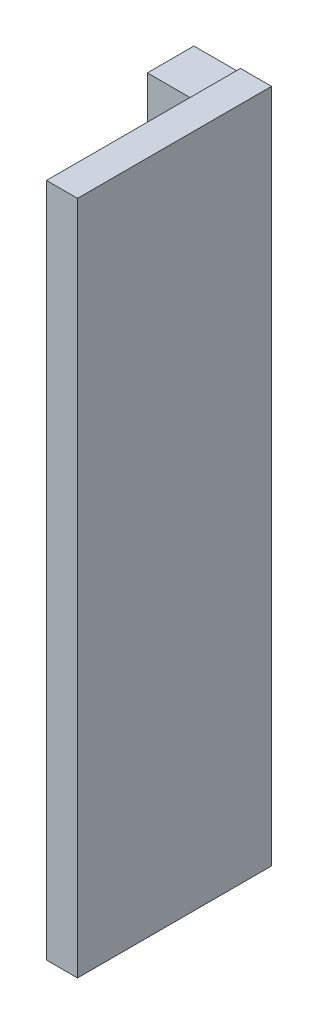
ISO-10303-21;
HEADER;
FILE_DESCRIPTION(('STEP AP214'),'2;1');
FILE_NAME('part.step','',(''),(''),'','','');
FILE_SCHEMA(('AUTOMOTIVE_DESIGN { 1 0 10303 214 1 1 1 1 }'));
ENDSEC;
DATA;
#1=APPLICATION_CONTEXT('core data for automotive mechanical design processes');
#2=APPLICATION_PROTOCOL_DEFINITION('international standard','automotive_design',2000,#1);
#3=PRODUCT_CONTEXT('',#1,'mechanical');
#4=PRODUCT('Part','Part','',(#3));
#5=PRODUCT_RELATED_PRODUCT_CATEGORY('part','',(#4));
#6=PRODUCT_DEFINITION_FORMATION('','',#4);
#7=PRODUCT_DEFINITION_CONTEXT('part definition',#1,'design');
#8=PRODUCT_DEFINITION('design','',#6,#7);
#9=PRODUCT_DEFINITION_SHAPE('','',#8);
#10=(LENGTH_UNIT() NAMED_UNIT(*) SI_UNIT(.MILLI.,.METRE.));
#11=(NAMED_UNIT(*) PLANE_ANGLE_UNIT() SI_UNIT($,.RADIAN.));
#12=(NAMED_UNIT(*) SI_UNIT($,.STERADIAN.) SOLID_ANGLE_UNIT());
#13=UNCERTAINTY_MEASURE_WITH_UNIT(LENGTH_MEASURE(1.E-05),#10,'distance_accuracy_value','');
#14=(GEOMETRIC_REPRESENTATION_CONTEXT(3) GLOBAL_UNCERTAINTY_ASSIGNED_CONTEXT((#13)) GLOBAL_UNIT_ASSIGNED_CONTEXT((#10,
#11,#12)) REPRESENTATION_CONTEXT('',''));
#15=CARTESIAN_POINT('',(0.,0.,0.));
#16=DIRECTION('',(0.,0.,1.));
#17=DIRECTION('',(1.,0.,0.));
#18=AXIS2_PLACEMENT_3D('',#15,#16,#17);
#19=CARTESIAN_POINT('',(3.89999999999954,-43.5,0.));
#20=DIRECTION('',(0.,1.,0.));
#21=DIRECTION('',(-1.,0.,0.));
#22=AXIS2_PLACEMENT_3D('',#19,#20,#21);
#23=PLANE('',#22);
#24=DIRECTION('',(1.,0.,0.));
#25=VECTOR('',#24,1.);
#26=CARTESIAN_POINT('',(3.89999999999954,-43.5,0.));
#27=LINE('',#26,#25);
#28=CARTESIAN_POINT('',(-4.55581752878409E-13,-43.5,0.));
#29=VERTEX_POINT('',#28);
#30=CARTESIAN_POINT('',(3.99999999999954,-43.5,0.));
#31=VERTEX_POINT('',#30);
#32=EDGE_CURVE('E46',#29,#31,#27,.T.);
#33=ORIENTED_EDGE('',*,*,#32,.T.);
#34=DIRECTION('',(0.,0.,-1.));
#35=VECTOR('',#34,1.);
#36=CARTESIAN_POINT('',(3.99999999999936,-43.5,25.));
#37=LINE('',#36,#35);
#38=CARTESIAN_POINT('',(3.99999999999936,-43.5,25.));
#39=VERTEX_POINT('',#38);
#40=EDGE_CURVE('E134',#39,#31,#37,.T.);
#41=ORIENTED_EDGE('',*,*,#40,.F.);
#42=DIRECTION('',(1.,0.,0.));
#43=VECTOR('',#42,1.);
#44=CARTESIAN_POINT('',(-5.60315682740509E-13,-43.5,25.));
#45=LINE('',#44,#43);
#46=CARTESIAN_POINT('',(-5.60315682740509E-13,-43.5,25.));
#47=VERTEX_POINT('',#46);
#48=EDGE_CURVE('E139',#47,#39,#45,.T.);
#49=ORIENTED_EDGE('',*,*,#48,.F.);
#50=DIRECTION('',(0.,0.,-1.));
#51=VECTOR('',#50,1.);
#52=CARTESIAN_POINT('',(-4.55581752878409E-13,-43.5,0.));
#53=LINE('',#52,#51);
#54=EDGE_CURVE('E109',#47,#29,#53,.T.);
#55=ORIENTED_EDGE('',*,*,#54,.T.);
#56=EDGE_LOOP('',(#33,#41,#49,#55));
#57=FACE_BOUND('',#56,.T.);
#58=ADVANCED_FACE('F16',(#57),#23,.F.);
#59=CARTESIAN_POINT('',(3.90000000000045,43.5,0.));
#60=DIRECTION('',(0.,1.,0.));
#61=DIRECTION('',(-1.,0.,0.));
#62=AXIS2_PLACEMENT_3D('',#59,#60,#61);
#63=PLANE('',#62);
#64=DIRECTION('',(-1.,0.,0.));
#65=VECTOR('',#64,1.);
#66=CARTESIAN_POINT('',(3.90000000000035,43.5,25.));
#67=LINE('',#66,#65);
#68=CARTESIAN_POINT('',(4.00000000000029,43.5,25.));
#69=VERTEX_POINT('',#68);
#70=CARTESIAN_POINT('',(3.50847823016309E-13,43.5,25.));
#71=VERTEX_POINT('',#70);
#72=EDGE_CURVE('E125',#69,#71,#67,.T.);
#73=ORIENTED_EDGE('',*,*,#72,.F.);
#74=DIRECTION('',(0.,0.,1.));
#75=VECTOR('',#74,1.);
#76=CARTESIAN_POINT('',(4.00000000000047,43.5,0.));
#77=LINE('',#76,#75);
#78=CARTESIAN_POINT('',(4.00000000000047,43.5,0.));
#79=VERTEX_POINT('',#78);
#80=EDGE_CURVE('E123',#79,#69,#77,.T.);
#81=ORIENTED_EDGE('',*,*,#80,.F.);
#82=DIRECTION('',(1.,0.,0.));
#83=VECTOR('',#82,1.);
#84=CARTESIAN_POINT('',(3.90000000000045,43.5,0.));
#85=LINE('',#84,#83);
#86=CARTESIAN_POINT('',(4.55581752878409E-13,43.5,0.));
#87=VERTEX_POINT('',#86);
#88=EDGE_CURVE('E20',#87,#79,#85,.T.);
#89=ORIENTED_EDGE('',*,*,#88,.F.);
#90=DIRECTION('',(0.,0.,-1.));
#91=VECTOR('',#90,1.);
#92=CARTESIAN_POINT('',(4.55581752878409E-13,43.5,0.));
#93=LINE('',#92,#91);
#94=EDGE_CURVE('E111',#71,#87,#93,.T.);
#95=ORIENTED_EDGE('',*,*,#94,.F.);
#96=EDGE_LOOP('',(#73,#81,#89,#95));
#97=FACE_BOUND('',#96,.T.);
#98=ADVANCED_FACE('F124',(#97),#63,.T.);
#99=CARTESIAN_POINT('',(3.90000000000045,43.5,0.));
#100=DIRECTION('',(0.,0.,1.));
#101=DIRECTION('',(1.,0.,0.));
#102=AXIS2_PLACEMENT_3D('',#99,#100,#101);
#103=PLANE('',#102);
#104=ORIENTED_EDGE('',*,*,#88,.T.);
#105=DIRECTION('',(0.,1.,0.));
#106=VECTOR('',#105,1.);
#107=CARTESIAN_POINT('',(3.99999999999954,-43.5,0.));
#108=LINE('',#107,#106);
#109=EDGE_CURVE('E117',#31,#79,#108,.T.);
#110=ORIENTED_EDGE('',*,*,#109,.F.);
#111=ORIENTED_EDGE('',*,*,#32,.F.);
#112=DIRECTION('',(0.,-1.,0.));
#113=VECTOR('',#112,1.);
#114=CARTESIAN_POINT('',(4.55581752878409E-13,43.5,0.));
#115=LINE('',#114,#113);
#116=CARTESIAN_POINT('',(-4.50377582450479E-13,-43.,0.));
#117=VERTEX_POINT('',#116);
#118=EDGE_CURVE('E107',#29,#117,#115,.F.);
#119=ORIENTED_EDGE('',*,*,#118,.T.);
#120=DIRECTION('',(1.,0.,0.));
#121=VECTOR('',#120,1.);
#122=CARTESIAN_POINT('',(-4.50377582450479E-13,-43.,0.));
#123=LINE('',#122,#121);
#124=CARTESIAN_POINT('',(-6.00000000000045,-43.,0.));
#125=VERTEX_POINT('',#124);
#126=EDGE_CURVE('E100',#125,#117,#123,.T.);
#127=ORIENTED_EDGE('',*,*,#126,.F.);
#128=DIRECTION('',(0.,-1.,0.));
#129=VECTOR('',#128,1.);
#130=CARTESIAN_POINT('',(-5.99999999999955,43.,-1.05821534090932E-13));
#131=LINE('',#130,#129);
#132=CARTESIAN_POINT('',(-5.99999999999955,43.,-1.09290981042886E-13));
#133=VERTEX_POINT('',#132);
#134=EDGE_CURVE('E34',#125,#133,#131,.F.);
#135=ORIENTED_EDGE('',*,*,#134,.T.);
#136=DIRECTION('',(1.,0.,0.));
#137=VECTOR('',#136,1.);
#138=CARTESIAN_POINT('',(4.50377582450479E-13,43.,0.));
#139=LINE('',#138,#137);
#140=CARTESIAN_POINT('',(4.50377582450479E-13,43.,0.));
#141=VERTEX_POINT('',#140);
#142=EDGE_CURVE('E10',#133,#141,#139,.T.);
#143=ORIENTED_EDGE('',*,*,#142,.T.);
#144=EDGE_CURVE('E97',#141,#87,#115,.F.);
#145=ORIENTED_EDGE('',*,*,#144,.T.);
#146=EDGE_LOOP('',(#104,#110,#111,#119,#127,#135,#143,#145));
#147=FACE_BOUND('',#146,.T.);
#148=ADVANCED_FACE('F18',(#147),#103,.F.);
#149=CARTESIAN_POINT('',(3.50847823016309E-13,43.5,15.));
#150=DIRECTION('',(1.,0.,0.));
#151=DIRECTION('',(0.,0.,-1.));
#152=AXIS2_PLACEMENT_3D('',#149,#150,#151);
#153=PLANE('',#152);
#154=DIRECTION('',(0.,0.,1.));
#155=VECTOR('',#154,1.);
#156=CARTESIAN_POINT('',(5.38197958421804E-13,43.,-9.));
#157=LINE('',#156,#155);
#158=CARTESIAN_POINT('',(4.08527378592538E-13,43.,6.));
#159=VERTEX_POINT('',#158);
#160=EDGE_CURVE('E94',#141,#159,#157,.T.);
#161=ORIENTED_EDGE('',*,*,#160,.T.);
#162=DIRECTION('',(0.,-1.,0.));
#163=VECTOR('',#162,1.);
#164=CARTESIAN_POINT('',(4.08527378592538E-13,43.,6.));
#165=LINE('',#164,#163);
#166=CARTESIAN_POINT('',(-4.92227786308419E-13,-43.,6.));
#167=VERTEX_POINT('',#166);
#168=EDGE_CURVE('E82',#167,#159,#165,.F.);
#169=ORIENTED_EDGE('',*,*,#168,.F.);
#170=DIRECTION('',(0.,0.,1.));
#171=VECTOR('',#170,1.);
#172=CARTESIAN_POINT('',(-3.8749385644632E-13,-43.,-9.));
#173=LINE('',#172,#171);
#174=EDGE_CURVE('E146',#117,#167,#173,.T.);
#175=ORIENTED_EDGE('',*,*,#174,.F.);
#176=ORIENTED_EDGE('',*,*,#118,.F.);
#177=ORIENTED_EDGE('',*,*,#54,.F.);
#178=DIRECTION('',(0.,-1.,0.));
#179=VECTOR('',#178,1.);
#180=CARTESIAN_POINT('',(3.50847823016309E-13,43.5,25.));
#181=LINE('',#180,#179);
#182=EDGE_CURVE('E57',#71,#47,#181,.T.);
#183=ORIENTED_EDGE('',*,*,#182,.F.);
#184=ORIENTED_EDGE('',*,*,#94,.T.);
#185=ORIENTED_EDGE('',*,*,#144,.F.);
#186=EDGE_LOOP('',(#161,#169,#175,#176,#177,#183,#184,#185));
#187=FACE_BOUND('',#186,.T.);
#188=ADVANCED_FACE('F95',(#187),#153,.F.);
#189=CARTESIAN_POINT('',(-3.8749385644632E-13,-43.,-9.));
#190=DIRECTION('',(0.,1.,0.));
#191=DIRECTION('',(-1.,0.,0.));
#192=AXIS2_PLACEMENT_3D('',#189,#190,#191);
#193=PLANE('',#192);
#194=DIRECTION('',(0.,0.,-1.));
#195=VECTOR('',#194,1.);
#196=CARTESIAN_POINT('',(-6.00000000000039,-43.,-9.));
#197=LINE('',#196,#195);
#198=CARTESIAN_POINT('',(-6.00000000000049,-43.,6.));
#199=VERTEX_POINT('',#198);
#200=EDGE_CURVE('E149',#199,#125,#197,.T.);
#201=ORIENTED_EDGE('',*,*,#200,.T.);
#202=ORIENTED_EDGE('',*,*,#126,.T.);
#203=ORIENTED_EDGE('',*,*,#174,.T.);
#204=DIRECTION('',(-1.,0.,0.));
#205=VECTOR('',#204,1.);
#206=CARTESIAN_POINT('',(-4.92227786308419E-13,-43.,6.));
#207=LINE('',#206,#205);
#208=EDGE_CURVE('E90',#167,#199,#207,.T.);
#209=ORIENTED_EDGE('',*,*,#208,.T.);
#210=EDGE_LOOP('',(#201,#202,#203,#209));
#211=FACE_BOUND('',#210,.T.);
#212=ADVANCED_FACE('F152',(#211),#193,.F.);
#213=CARTESIAN_POINT('',(5.38197958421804E-13,43.,-9.));
#214=DIRECTION('',(0.,1.,0.));
#215=DIRECTION('',(-1.,0.,0.));
#216=AXIS2_PLACEMENT_3D('',#213,#214,#215);
#217=PLANE('',#216);
#218=ORIENTED_EDGE('',*,*,#142,.F.);
#219=DIRECTION('',(0.,0.,-1.));
#220=VECTOR('',#219,1.);
#221=CARTESIAN_POINT('',(-5.99999999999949,43.,-9.));
#222=LINE('',#221,#220);
#223=CARTESIAN_POINT('',(-5.99999999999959,43.,6.));
#224=VERTEX_POINT('',#223);
#225=EDGE_CURVE('E26',#224,#133,#222,.T.);
#226=ORIENTED_EDGE('',*,*,#225,.F.);
#227=DIRECTION('',(-1.,0.,0.));
#228=VECTOR('',#227,1.);
#229=CARTESIAN_POINT('',(4.08527378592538E-13,43.,6.));
#230=LINE('',#229,#228);
#231=EDGE_CURVE('E87',#159,#224,#230,.T.);
#232=ORIENTED_EDGE('',*,*,#231,.F.);
#233=ORIENTED_EDGE('',*,*,#160,.F.);
#234=EDGE_LOOP('',(#218,#226,#232,#233));
#235=FACE_BOUND('',#234,.T.);
#236=ADVANCED_FACE('F102',(#235),#217,.T.);
#237=CARTESIAN_POINT('',(4.08527378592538E-13,43.,6.));
#238=DIRECTION('',(0.,0.,-1.));
#239=DIRECTION('',(-1.,0.,0.));
#240=AXIS2_PLACEMENT_3D('',#237,#238,#239);
#241=PLANE('',#240);
#242=ORIENTED_EDGE('',*,*,#231,.T.);
#243=DIRECTION('',(0.,-1.,0.));
#244=VECTOR('',#243,1.);
#245=CARTESIAN_POINT('',(-5.99999999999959,43.,6.));
#246=LINE('',#245,#244);
#247=EDGE_CURVE('E144',#199,#224,#246,.F.);
#248=ORIENTED_EDGE('',*,*,#247,.F.);
#249=ORIENTED_EDGE('',*,*,#208,.F.);
#250=ORIENTED_EDGE('',*,*,#168,.T.);
#251=EDGE_LOOP('',(#242,#248,#249,#250));
#252=FACE_BOUND('',#251,.T.);
#253=ADVANCED_FACE('F84',(#252),#241,.F.);
#254=CARTESIAN_POINT('',(-5.99999999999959,43.,6.));
#255=DIRECTION('',(1.,0.,0.));
#256=DIRECTION('',(0.,0.,-1.));
#257=AXIS2_PLACEMENT_3D('',#254,#255,#256);
#258=PLANE('',#257);
#259=ORIENTED_EDGE('',*,*,#225,.T.);
#260=ORIENTED_EDGE('',*,*,#134,.F.);
#261=ORIENTED_EDGE('',*,*,#200,.F.);
#262=ORIENTED_EDGE('',*,*,#247,.T.);
#263=EDGE_LOOP('',(#259,#260,#261,#262));
#264=FACE_BOUND('',#263,.T.);
#265=ADVANCED_FACE('F155',(#264),#258,.F.);
#266=CARTESIAN_POINT('',(0.,0.,25.));
#267=DIRECTION('',(0.,0.,1.));
#268=DIRECTION('',(1.,0.,0.));
#269=AXIS2_PLACEMENT_3D('',#266,#267,#268);
#270=PLANE('',#269);
#271=ORIENTED_EDGE('',*,*,#182,.T.);
#272=ORIENTED_EDGE('',*,*,#48,.T.);
#273=DIRECTION('',(0.,-1.,0.));
#274=VECTOR('',#273,1.);
#275=CARTESIAN_POINT('',(4.00000000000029,43.5,25.));
#276=LINE('',#275,#274);
#277=EDGE_CURVE('E129',#69,#39,#276,.T.);
#278=ORIENTED_EDGE('',*,*,#277,.F.);
#279=ORIENTED_EDGE('',*,*,#72,.T.);
#280=EDGE_LOOP('',(#271,#272,#278,#279));
#281=FACE_BOUND('',#280,.T.);
#282=ADVANCED_FACE('F157',(#281),#270,.T.);
#283=CARTESIAN_POINT('',(4.,0.,0.));
#284=DIRECTION('',(1.,0.,0.));
#285=DIRECTION('',(0.,1.,0.));
#286=AXIS2_PLACEMENT_3D('',#283,#284,#285);
#287=PLANE('',#286);
#288=ORIENTED_EDGE('',*,*,#109,.T.);
#289=ORIENTED_EDGE('',*,*,#80,.T.);
#290=ORIENTED_EDGE('',*,*,#277,.T.);
#291=ORIENTED_EDGE('',*,*,#40,.T.);
#292=EDGE_LOOP('',(#288,#289,#290,#291));
#293=FACE_BOUND('',#292,.T.);
#294=ADVANCED_FACE('F132',(#293),#287,.T.);
#295=CLOSED_SHELL('',(#58,#98,#148,#188,#212,#236,#253,#265,#282,#294));
#296=MANIFOLD_SOLID_BREP('B1',#295);
#297=ADVANCED_BREP_SHAPE_REPRESENTATION('',(#18,#296),#14);
#298=SHAPE_DEFINITION_REPRESENTATION(#9,#297);
ENDSEC;
END-ISO-10303-21;
